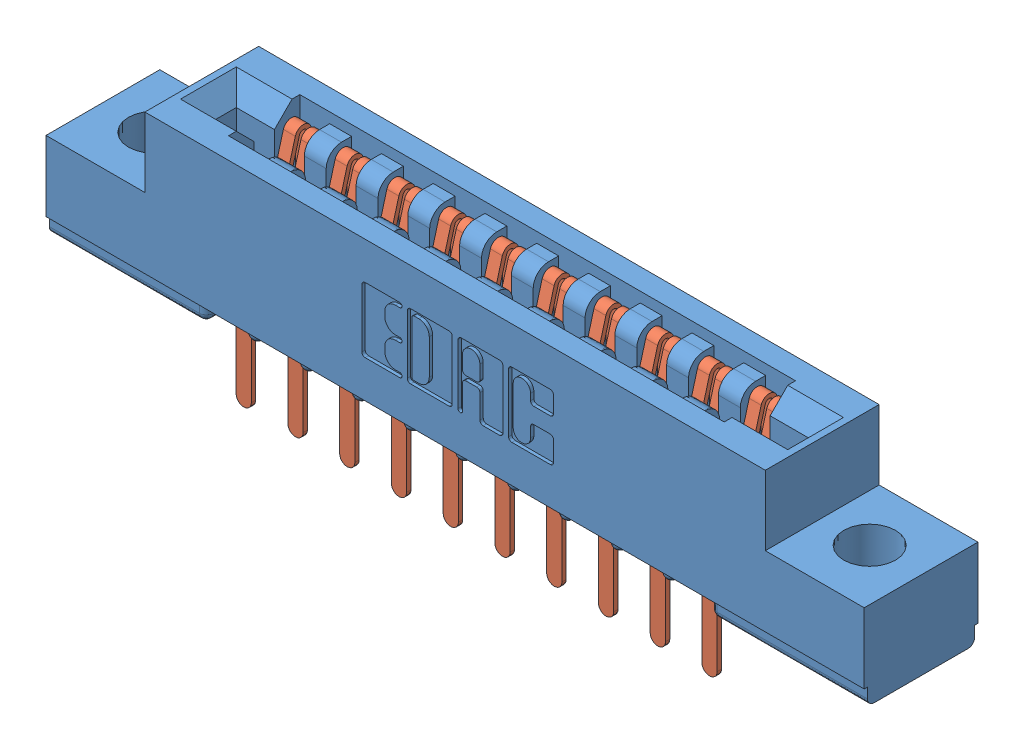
SolidWorks assembly EDAC-307-020-520-202.sldasm, configuration Default (file format 9000). Lengths in mm.
Overall size (62.64 17.42 8.71).
21 component instances, 2 part files, 0 mates.
Components (placement in the parent):
- EDAC-307-020-520-202_307 Part(.128 Dia Mounting Holes)-1: EDAC-307-020-520-202_307 Part(.128 Dia Mounting Holes).sldprt [Default] at origin size (62.64 12.01 8.71)
- EDAC-307-020-520-202_307-290-001(520)-1: EDAC-307-020-520-202_307-290-001(520).sldprt [Default] at (13.4874 2.9464 -1.651) x (0 0 -1) z (1 0 0) size (2.16 16.23 2.26)
- EDAC-307-020-520-202_307-290-001(520)-2: EDAC-307-020-520-202_307-290-001(520).sldprt [Default] at (49.149 2.9464 -1.651) x (0 0 -1) z (1 0 0) size (2.16 16.23 2.26)
- EDAC-307-020-520-202_307-290-001(520)-3: EDAC-307-020-520-202_307-290-001(520).sldprt [Default] at (21.4122 2.9464 -7.0612) x (0 0 1) z (-1 0 0) size (2.16 16.23 2.26)
- EDAC-307-020-520-202_307-290-001(520)-4: EDAC-307-020-520-202_307-290-001(520).sldprt [Default] at (37.2618 2.9464 -1.651) x (0 0 -1) z (1 0 0) size (2.16 16.23 2.26)
- EDAC-307-020-520-202_307-290-001(520)-5: EDAC-307-020-520-202_307-290-001(520).sldprt [Default] at (41.2242 2.9464 -1.651) x (0 0 -1) z (1 0 0) size (2.16 16.23 2.26)
- EDAC-307-020-520-202_307-290-001(520)-6: EDAC-307-020-520-202_307-290-001(520).sldprt [Default] at (29.337 2.9464 -1.651) x (0 0 -1) z (1 0 0) size (2.16 16.23 2.26)
- EDAC-307-020-520-202_307-290-001(520)-7: EDAC-307-020-520-202_307-290-001(520).sldprt [Default] at (33.2994 2.9464 -1.651) x (0 0 -1) z (1 0 0) size (2.16 16.23 2.26)
- EDAC-307-020-520-202_307-290-001(520)-8: EDAC-307-020-520-202_307-290-001(520).sldprt [Default] at (21.4122 2.9464 -1.651) x (0 0 -1) z (1 0 0) size (2.16 16.23 2.26)
- EDAC-307-020-520-202_307-290-001(520)-9: EDAC-307-020-520-202_307-290-001(520).sldprt [Default] at (25.3746 2.9464 -7.0612) x (0 0 1) z (-1 0 0) size (2.16 16.23 2.26)
- EDAC-307-020-520-202_307-290-001(520)-10: EDAC-307-020-520-202_307-290-001(520).sldprt [Default] at (25.3746 2.9464 -1.651) x (0 0 -1) z (1 0 0) size (2.16 16.23 2.26)
- EDAC-307-020-520-202_307-290-001(520)-11: EDAC-307-020-520-202_307-290-001(520).sldprt [Default] at (29.337 2.9464 -7.0612) x (0 0 1) z (-1 0 0) size (2.16 16.23 2.26)
- EDAC-307-020-520-202_307-290-001(520)-12: EDAC-307-020-520-202_307-290-001(520).sldprt [Default] at (33.2994 2.9464 -7.0612) x (0 0 1) z (-1 0 0) size (2.16 16.23 2.26)
- EDAC-307-020-520-202_307-290-001(520)-13: EDAC-307-020-520-202_307-290-001(520).sldprt [Default] at (49.149 2.9464 -7.0612) x (0 0 1) z (-1 0 0) size (2.16 16.23 2.26)
- EDAC-307-020-520-202_307-290-001(520)-14: EDAC-307-020-520-202_307-290-001(520).sldprt [Default] at (17.4498 2.9464 -1.651) x (0 0 -1) z (1 0 0) size (2.16 16.23 2.26)
- EDAC-307-020-520-202_307-290-001(520)-15: EDAC-307-020-520-202_307-290-001(520).sldprt [Default] at (45.1866 2.9464 -7.0612) x (0 0 1) z (-1 0 0) size (2.16 16.23 2.26)
- EDAC-307-020-520-202_307-290-001(520)-16: EDAC-307-020-520-202_307-290-001(520).sldprt [Default] at (37.2618 2.9464 -7.0612) x (0 0 1) z (-1 0 0) size (2.16 16.23 2.26)
- EDAC-307-020-520-202_307-290-001(520)-17: EDAC-307-020-520-202_307-290-001(520).sldprt [Default] at (13.4874 2.9464 -7.0612) x (0 0 1) z (-1 0 0) size (2.16 16.23 2.26)
- EDAC-307-020-520-202_307-290-001(520)-18: EDAC-307-020-520-202_307-290-001(520).sldprt [Default] at (41.2242 2.9464 -7.0612) x (0 0 1) z (-1 0 0) size (2.16 16.23 2.26)
- EDAC-307-020-520-202_307-290-001(520)-19: EDAC-307-020-520-202_307-290-001(520).sldprt [Default] at (17.4498 2.9464 -7.0612) x (0 0 1) z (-1 0 0) size (2.16 16.23 2.26)
- EDAC-307-020-520-202_307-290-001(520)-20: EDAC-307-020-520-202_307-290-001(520).sldprt [Default] at (45.1866 2.9464 -1.651) x (0 0 -1) z (1 0 0) size (2.16 16.23 2.26)
